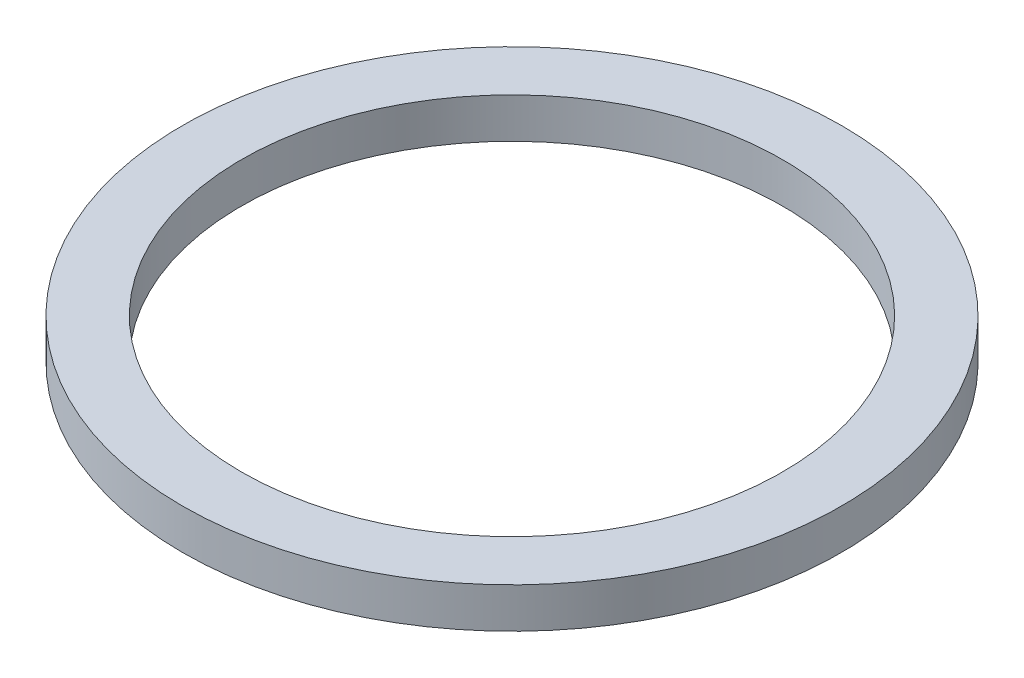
from build123d import *

# Parameters (mm, degrees)
SKETCH1_R          = 12.065
EXTRUDE1_DEPTH     = 1.4732
SKETCH2_R          = 9.906
CUT_EXTRUDE1_DEPTH = 18.125967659


with BuildPart() as part:
    # Sketch1 → Extrude1 (new body)
    with BuildSketch(Plane(origin=(0, 0, 0), x_dir=(1, 0, 0), z_dir=(0, 1, 0))):
        with Locations(Location((0, 0, 0), (0, 0, 270))):
            Circle(SKETCH1_R)
    extrude(amount=EXTRUDE1_DEPTH)

    # Sketch2 → Cut-Extrude1 (cut, through all)
    with BuildSketch(Plane(origin=(0, 1.4732, 0), x_dir=(-1, 0, 0), z_dir=(0, 1, 0))):
        with Locations(Location((0, 0, 0), (0, 0, 90))):
            Circle(SKETCH2_R)
    extrude(amount=-CUT_EXTRUDE1_DEPTH, mode=Mode.SUBTRACT)


solid = part.part
